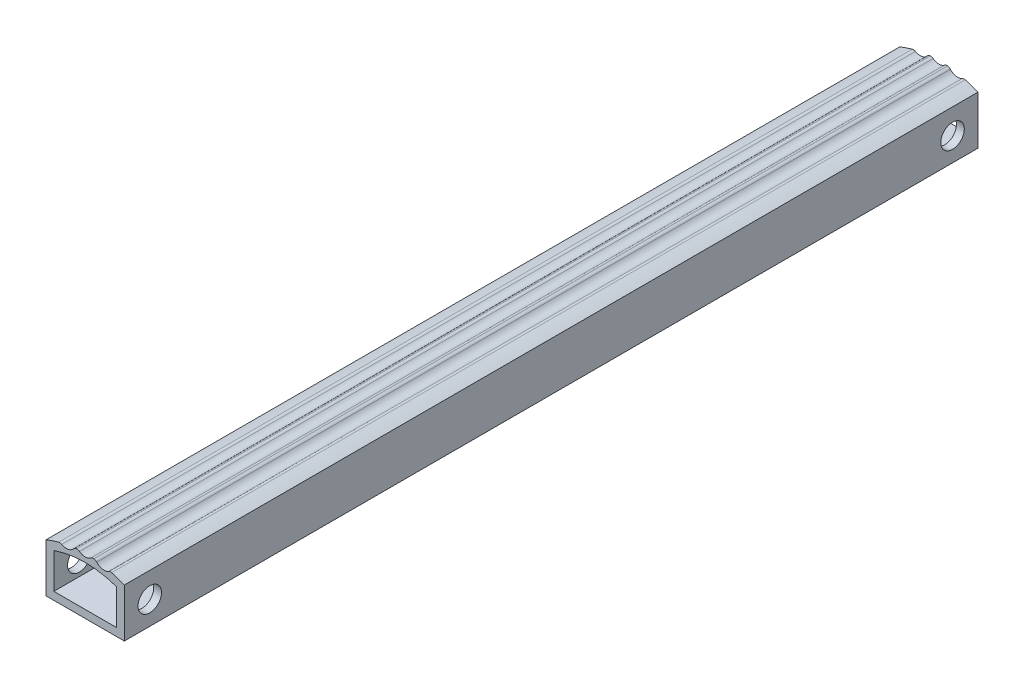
from build123d import *

# Parameters (mm, degrees)
BOSS_EXTRU_1_DEPTH      = 54.5
ESQUISSE2_R             = 1.5
ENL_V_MAT_EXTRU_1_DEPTH = 56.87007968


with BuildPart() as part:
    # Esquisse1 → Boss.-Extru.1 (new, symmetric)
    with BuildSketch(Plane.XY):
        with BuildLine():
            Line((-5, 0), (5, 0))
            Line((5, 0), (5, 6.2))
            ThreePointArc((5, 6.2), (4.198380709, 6.503397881), (3.378511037, 6.753312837))
            ThreePointArc((3.378511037, 6.753312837), (3.182940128, 6.766167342), (2.997453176, 6.702860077))
            ThreePointArc((2.997453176, 6.702860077), (2.185788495, 6.558879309), (1.472744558, 6.972519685))
            ThreePointArc((1.472744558, 6.972519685), (1.320223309, 7.095607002), (1.132107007, 7.150611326))
            ThreePointArc((1.132107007, 7.150611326), (1.107721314, 7.152719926), (1.083331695, 7.154782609))
            ThreePointArc((1.083331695, 7.154782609), (0.899623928, 7.135921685), (0.735293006, 7.051662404))
            ThreePointArc((0.735293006, 7.051662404), (0, 6.8), (-0.735293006, 7.051662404))
            ThreePointArc((-0.735293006, 7.051662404), (-0.899623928, 7.135921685), (-1.083331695, 7.154782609))
            ThreePointArc((-1.083331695, 7.154782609), (-1.107721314, 7.152719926), (-1.132107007, 7.150611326))
            ThreePointArc((-1.132107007, 7.150611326), (-1.320223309, 7.095607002), (-1.472744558, 6.972519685))
            ThreePointArc((-1.472744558, 6.972519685), (-2.185788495, 6.558879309), (-2.997453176, 6.702860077))
            ThreePointArc((-2.997453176, 6.702860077), (-3.182940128, 6.766167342), (-3.378511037, 6.753312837))
            ThreePointArc((-3.378511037, 6.753312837), (-4.198380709, 6.503397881), (-5, 6.2))
            Line((-5, 6.2), (-5, 0))
        make_face()
        with BuildLine():
            Line((-4, 1), (-4, 5.513708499))
            ThreePointArc((-4, 5.513708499), (0, 6.2), (4, 5.513708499))
            Line((4, 5.513708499), (4, 1))
            Line((4, 1), (-4, 1))
        make_face(mode=Mode.SUBTRACT)
    extrude(amount=BOSS_EXTRU_1_DEPTH, both=True)

    # Esquisse2 → Enl_v. mat.-Extru.1 (cut, through all)
    with BuildSketch(Plane.ZY.offset(5)):
        with Locations((-51.25, 3)):
            Circle(ESQUISSE2_R)
        with Locations((51.25, 3)):
            Circle(ESQUISSE2_R)
    extrude(amount=-ENL_V_MAT_EXTRU_1_DEPTH, mode=Mode.SUBTRACT)


solid = part.part
